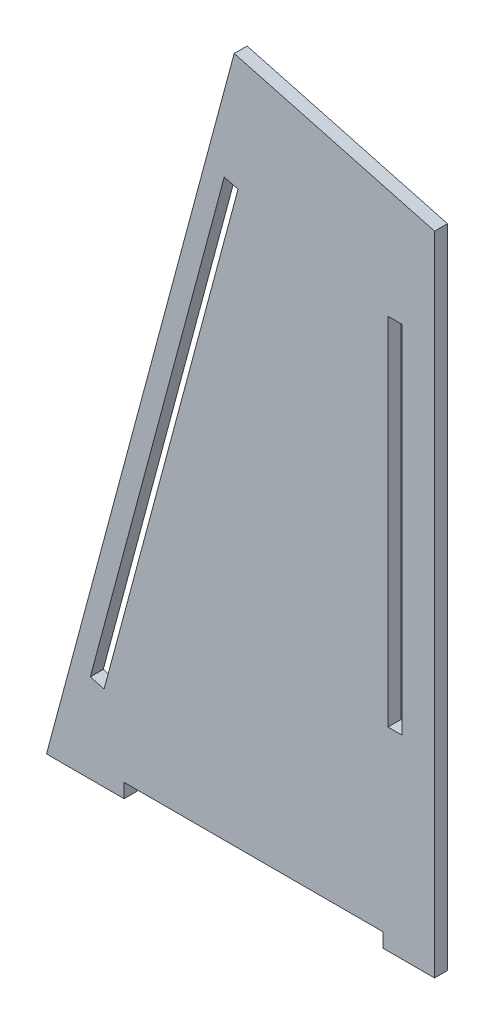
from build123d import *

# Parameters (mm, degrees)
EXTRUDE_1_DEPTH     = 2
SKETCH_2_W          = 40
SKETCH_2_H          = 2.2
SKETCH_2_W_2        = 2.2
SKETCH_2_H_2        = 55
CUT_EXTRUDE_1_DEPTH = 2


with BuildPart() as part:
    # Sketch 1 → Extrude 1 (new body)
    with BuildSketch(Plane.XY):
        Polygon((0, 0), (29.019237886, 108.301270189), (60, 100), (60, 0), align=None)
    extrude(amount=EXTRUDE_1_DEPTH)

    # Sketch 2 → Cut-Extrude 1 (cut)
    with BuildSketch(Plane.XY.offset(2)):
        Polygon((27.485586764, 90.986496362), (29.610623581, 90.417094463), (8.905099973, 13.14302836), (6.780063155, 13.712430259), align=None)
        with Locations((32, 1.1)):
            Rectangle(SKETCH_2_W, SKETCH_2_H)
        with Locations((53.9, 57.5)):
            Rectangle(SKETCH_2_W_2, SKETCH_2_H_2)
    extrude(amount=-CUT_EXTRUDE_1_DEPTH, mode=Mode.SUBTRACT)


solid = part.part
